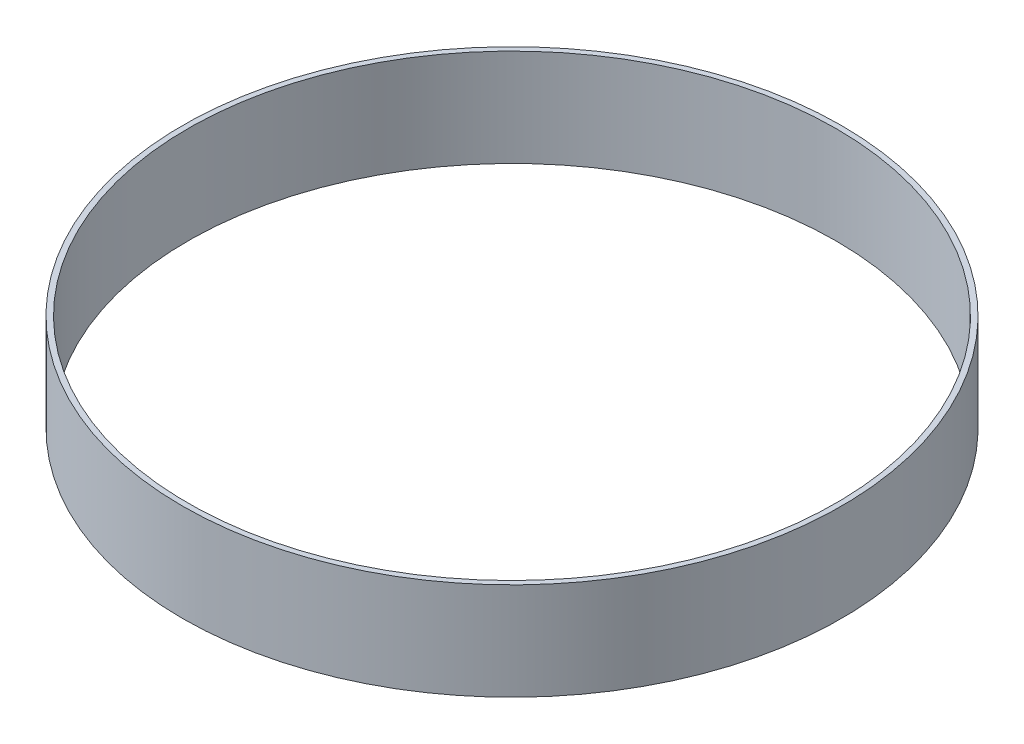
ISO-10303-21;
HEADER;
FILE_DESCRIPTION(('STEP AP214'),'2;1');
FILE_NAME('part.step','',(''),(''),'','','');
FILE_SCHEMA(('AUTOMOTIVE_DESIGN { 1 0 10303 214 1 1 1 1 }'));
ENDSEC;
DATA;
#1=APPLICATION_CONTEXT('core data for automotive mechanical design processes');
#2=APPLICATION_PROTOCOL_DEFINITION('international standard','automotive_design',2000,#1);
#3=PRODUCT_CONTEXT('',#1,'mechanical');
#4=PRODUCT('Part','Part','',(#3));
#5=PRODUCT_RELATED_PRODUCT_CATEGORY('part','',(#4));
#6=PRODUCT_DEFINITION_FORMATION('','',#4);
#7=PRODUCT_DEFINITION_CONTEXT('part definition',#1,'design');
#8=PRODUCT_DEFINITION('design','',#6,#7);
#9=PRODUCT_DEFINITION_SHAPE('','',#8);
#10=(LENGTH_UNIT() NAMED_UNIT(*) SI_UNIT(.MILLI.,.METRE.));
#11=(NAMED_UNIT(*) PLANE_ANGLE_UNIT() SI_UNIT($,.RADIAN.));
#12=(NAMED_UNIT(*) SI_UNIT($,.STERADIAN.) SOLID_ANGLE_UNIT());
#13=UNCERTAINTY_MEASURE_WITH_UNIT(LENGTH_MEASURE(1.E-05),#10,'distance_accuracy_value','');
#14=(GEOMETRIC_REPRESENTATION_CONTEXT(3) GLOBAL_UNCERTAINTY_ASSIGNED_CONTEXT((#13)) GLOBAL_UNIT_ASSIGNED_CONTEXT((#10,
#11,#12)) REPRESENTATION_CONTEXT('',''));
#15=CARTESIAN_POINT('',(0.,0.,0.));
#16=DIRECTION('',(0.,0.,1.));
#17=DIRECTION('',(1.,0.,0.));
#18=AXIS2_PLACEMENT_3D('',#15,#16,#17);
#19=CARTESIAN_POINT('',(0.,76.2,0.));
#20=DIRECTION('',(0.,1.,0.));
#21=DIRECTION('',(0.,0.,1.));
#22=AXIS2_PLACEMENT_3D('',#19,#20,#21);
#23=PLANE('',#22);
#24=CARTESIAN_POINT('',(0.,76.2,0.));
#25=DIRECTION('',(0.,1.,0.));
#26=DIRECTION('',(0.,0.,1.));
#27=AXIS2_PLACEMENT_3D('',#24,#25,#26);
#28=CIRCLE('',#27,257.96875);
#29=CARTESIAN_POINT('',(0.,76.2,-257.96875));
#30=VERTEX_POINT('',#29);
#31=EDGE_CURVE('E10',#30,#30,#28,.T.);
#32=ORIENTED_EDGE('',*,*,#31,.T.);
#33=EDGE_LOOP('',(#32));
#34=FACE_BOUND('',#33,.T.);
#35=CARTESIAN_POINT('',(0.,76.2,0.));
#36=DIRECTION('',(0.,1.,0.));
#37=DIRECTION('',(0.,0.,1.));
#38=AXIS2_PLACEMENT_3D('',#35,#36,#37);
#39=CIRCLE('',#38,253.79299);
#40=CARTESIAN_POINT('',(0.,76.2,-253.79299));
#41=VERTEX_POINT('',#40);
#42=EDGE_CURVE('E45',#41,#41,#39,.T.);
#43=ORIENTED_EDGE('',*,*,#42,.F.);
#44=EDGE_LOOP('',(#43));
#45=FACE_BOUND('',#44,.T.);
#46=ADVANCED_FACE('F34',(#34,#45),#23,.T.);
#47=CARTESIAN_POINT('',(0.,0.,0.));
#48=DIRECTION('',(0.,1.,0.));
#49=DIRECTION('',(0.,0.,1.));
#50=AXIS2_PLACEMENT_3D('',#47,#48,#49);
#51=PLANE('',#50);
#52=CARTESIAN_POINT('',(0.,0.,0.));
#53=DIRECTION('',(0.,1.,0.));
#54=DIRECTION('',(0.,0.,1.));
#55=AXIS2_PLACEMENT_3D('',#52,#53,#54);
#56=CIRCLE('',#55,257.96875);
#57=CARTESIAN_POINT('',(0.,0.,-257.96875));
#58=VERTEX_POINT('',#57);
#59=EDGE_CURVE('E38',#58,#58,#56,.T.);
#60=ORIENTED_EDGE('',*,*,#59,.F.);
#61=EDGE_LOOP('',(#60));
#62=FACE_BOUND('',#61,.T.);
#63=CARTESIAN_POINT('',(0.,0.,0.));
#64=DIRECTION('',(0.,1.,0.));
#65=DIRECTION('',(0.,0.,1.));
#66=AXIS2_PLACEMENT_3D('',#63,#64,#65);
#67=CIRCLE('',#66,253.79299);
#68=CARTESIAN_POINT('',(0.,0.,-253.79299));
#69=VERTEX_POINT('',#68);
#70=EDGE_CURVE('E47',#69,#69,#67,.T.);
#71=ORIENTED_EDGE('',*,*,#70,.T.);
#72=EDGE_LOOP('',(#71));
#73=FACE_BOUND('',#72,.T.);
#74=ADVANCED_FACE('F57',(#62,#73),#51,.F.);
#75=CARTESIAN_POINT('',(0.,76.2,0.));
#76=DIRECTION('',(0.,-1.,0.));
#77=DIRECTION('',(0.,0.,-1.));
#78=AXIS2_PLACEMENT_3D('',#75,#76,#77);
#79=CYLINDRICAL_SURFACE('',#78,257.96875);
#80=CARTESIAN_POINT('',(0.,76.2,-257.96875));
#81=CARTESIAN_POINT('',(0.,75.40625,-257.96875));
#82=CARTESIAN_POINT('',(0.,74.6125,-257.96875));
#83=CARTESIAN_POINT('',(0.,73.025,-257.96875));
#84=CARTESIAN_POINT('',(0.,72.23125,-257.96875));
#85=CARTESIAN_POINT('',(0.,70.64375,-257.96875));
#86=CARTESIAN_POINT('',(0.,69.85,-257.96875));
#87=CARTESIAN_POINT('',(0.,68.2625,-257.96875));
#88=CARTESIAN_POINT('',(0.,67.46875,-257.96875));
#89=CARTESIAN_POINT('',(0.,65.88125,-257.96875));
#90=CARTESIAN_POINT('',(0.,65.0875,-257.96875));
#91=CARTESIAN_POINT('',(0.,63.5,-257.96875));
#92=CARTESIAN_POINT('',(0.,62.70625,-257.96875));
#93=CARTESIAN_POINT('',(0.,61.11875,-257.96875));
#94=CARTESIAN_POINT('',(0.,60.325,-257.96875));
#95=CARTESIAN_POINT('',(0.,58.7375,-257.96875));
#96=CARTESIAN_POINT('',(0.,57.94375,-257.96875));
#97=CARTESIAN_POINT('',(0.,56.35625,-257.96875));
#98=CARTESIAN_POINT('',(0.,55.5625,-257.96875));
#99=CARTESIAN_POINT('',(0.,53.975,-257.96875));
#100=CARTESIAN_POINT('',(0.,53.18125,-257.96875));
#101=CARTESIAN_POINT('',(0.,51.59375,-257.96875));
#102=CARTESIAN_POINT('',(0.,50.8,-257.96875));
#103=CARTESIAN_POINT('',(0.,49.2125,-257.96875));
#104=CARTESIAN_POINT('',(0.,48.41875,-257.96875));
#105=CARTESIAN_POINT('',(0.,46.83125,-257.96875));
#106=CARTESIAN_POINT('',(0.,46.0375,-257.96875));
#107=CARTESIAN_POINT('',(0.,44.45,-257.96875));
#108=CARTESIAN_POINT('',(0.,43.65625,-257.96875));
#109=CARTESIAN_POINT('',(0.,42.06875,-257.96875));
#110=CARTESIAN_POINT('',(0.,41.275,-257.96875));
#111=CARTESIAN_POINT('',(0.,39.6875,-257.96875));
#112=CARTESIAN_POINT('',(0.,38.89375,-257.96875));
#113=CARTESIAN_POINT('',(0.,37.30625,-257.96875));
#114=CARTESIAN_POINT('',(0.,36.5125,-257.96875));
#115=CARTESIAN_POINT('',(0.,34.925,-257.96875));
#116=CARTESIAN_POINT('',(0.,34.13125,-257.96875));
#117=CARTESIAN_POINT('',(0.,32.54375,-257.96875));
#118=CARTESIAN_POINT('',(0.,31.75,-257.96875));
#119=CARTESIAN_POINT('',(0.,30.1625,-257.96875));
#120=CARTESIAN_POINT('',(0.,29.36875,-257.96875));
#121=CARTESIAN_POINT('',(0.,27.78125,-257.96875));
#122=CARTESIAN_POINT('',(0.,26.9875,-257.96875));
#123=CARTESIAN_POINT('',(0.,25.4,-257.96875));
#124=CARTESIAN_POINT('',(0.,24.60625,-257.96875));
#125=CARTESIAN_POINT('',(0.,23.01875,-257.96875));
#126=CARTESIAN_POINT('',(0.,22.225,-257.96875));
#127=CARTESIAN_POINT('',(0.,20.6375,-257.96875));
#128=CARTESIAN_POINT('',(0.,19.84375,-257.96875));
#129=CARTESIAN_POINT('',(0.,18.25625,-257.96875));
#130=CARTESIAN_POINT('',(0.,17.4625,-257.96875));
#131=CARTESIAN_POINT('',(0.,15.875,-257.96875));
#132=CARTESIAN_POINT('',(0.,15.08125,-257.96875));
#133=CARTESIAN_POINT('',(0.,13.49375,-257.96875));
#134=CARTESIAN_POINT('',(0.,12.7,-257.96875));
#135=CARTESIAN_POINT('',(0.,11.1125,-257.96875));
#136=CARTESIAN_POINT('',(0.,10.31875,-257.96875));
#137=CARTESIAN_POINT('',(0.,8.73125,-257.96875));
#138=CARTESIAN_POINT('',(0.,7.93750000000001,-257.96875));
#139=CARTESIAN_POINT('',(0.,6.35,-257.96875));
#140=CARTESIAN_POINT('',(0.,5.55625,-257.96875));
#141=CARTESIAN_POINT('',(0.,3.96875,-257.96875));
#142=CARTESIAN_POINT('',(0.,3.175,-257.96875));
#143=CARTESIAN_POINT('',(0.,1.5875,-257.96875));
#144=CARTESIAN_POINT('',(0.,0.793750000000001,-257.96875));
#145=CARTESIAN_POINT('',(0.,0.,-257.96875));
#146=B_SPLINE_CURVE_WITH_KNOTS('',3,(#80,#81,#82,#83,#84,#85,#86,#87,#88,#89,#90,#91,#92,#93,
#94,#95,#96,#97,#98,#99,#100,#101,#102,#103,#104,#105,#106,#107,#108,#109,#110,#111,#112,#113,
#114,#115,#116,#117,#118,#119,#120,#121,#122,#123,#124,#125,#126,#127,#128,#129,#130,#131,#132,
#133,#134,#135,#136,#137,#138,#139,#140,#141,#142,#143,#144,#145),.UNSPECIFIED.,.F.,.F.,(4,2,2,
2,2,2,2,2,2,2,2,2,2,2,2,2,2,2,2,2,2,2,2,2,2,2,2,2,2,2,2,2,4),(0.,2.38124999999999,
4.76249999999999,7.14374999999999,9.52499999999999,11.90625,14.2875,16.66875,19.05,21.43125,
23.8125,26.19375,28.575,30.95625,33.3375,35.71875,38.1,40.48125,42.8625,45.24375,47.625,
50.00625,52.3875,54.76875,57.15,59.53125,61.9125,64.29375,66.675,69.05625,71.4375,73.81875,
76.2),.UNSPECIFIED.);
#147=EDGE_CURVE('BSEAM36',#30,#58,#146,.T.);
#148=ORIENTED_EDGE('',*,*,#31,.F.);
#149=ORIENTED_EDGE('',*,*,#59,.T.);
#150=ORIENTED_EDGE('',*,*,#147,.T.);
#151=ORIENTED_EDGE('',*,*,#147,.F.);
#152=EDGE_LOOP('',(#148,#150,#149,#151));
#153=FACE_BOUND('',#152,.T.);
#154=ADVANCED_FACE('F36',(#153),#79,.T.);
#155=CARTESIAN_POINT('',(0.,76.2,0.));
#156=DIRECTION('',(0.,-1.,0.));
#157=DIRECTION('',(0.,0.,-1.));
#158=AXIS2_PLACEMENT_3D('',#155,#156,#157);
#159=CYLINDRICAL_SURFACE('',#158,253.79299);
#160=CARTESIAN_POINT('',(0.,76.2,-253.79299));
#161=CARTESIAN_POINT('',(0.,75.40625,-253.79299));
#162=CARTESIAN_POINT('',(0.,74.6125,-253.79299));
#163=CARTESIAN_POINT('',(0.,73.025,-253.79299));
#164=CARTESIAN_POINT('',(0.,72.23125,-253.79299));
#165=CARTESIAN_POINT('',(0.,70.64375,-253.79299));
#166=CARTESIAN_POINT('',(0.,69.85,-253.79299));
#167=CARTESIAN_POINT('',(0.,68.2625,-253.79299));
#168=CARTESIAN_POINT('',(0.,67.46875,-253.79299));
#169=CARTESIAN_POINT('',(0.,65.88125,-253.79299));
#170=CARTESIAN_POINT('',(0.,65.0875,-253.79299));
#171=CARTESIAN_POINT('',(0.,63.5,-253.79299));
#172=CARTESIAN_POINT('',(0.,62.70625,-253.79299));
#173=CARTESIAN_POINT('',(0.,61.11875,-253.79299));
#174=CARTESIAN_POINT('',(0.,60.325,-253.79299));
#175=CARTESIAN_POINT('',(0.,58.7375,-253.79299));
#176=CARTESIAN_POINT('',(0.,57.94375,-253.79299));
#177=CARTESIAN_POINT('',(0.,56.35625,-253.79299));
#178=CARTESIAN_POINT('',(0.,55.5625,-253.79299));
#179=CARTESIAN_POINT('',(0.,53.975,-253.79299));
#180=CARTESIAN_POINT('',(0.,53.18125,-253.79299));
#181=CARTESIAN_POINT('',(0.,51.59375,-253.79299));
#182=CARTESIAN_POINT('',(0.,50.8,-253.79299));
#183=CARTESIAN_POINT('',(0.,49.2125,-253.79299));
#184=CARTESIAN_POINT('',(0.,48.41875,-253.79299));
#185=CARTESIAN_POINT('',(0.,46.83125,-253.79299));
#186=CARTESIAN_POINT('',(0.,46.0375,-253.79299));
#187=CARTESIAN_POINT('',(0.,44.45,-253.79299));
#188=CARTESIAN_POINT('',(0.,43.65625,-253.79299));
#189=CARTESIAN_POINT('',(0.,42.06875,-253.79299));
#190=CARTESIAN_POINT('',(0.,41.275,-253.79299));
#191=CARTESIAN_POINT('',(0.,39.6875,-253.79299));
#192=CARTESIAN_POINT('',(0.,38.89375,-253.79299));
#193=CARTESIAN_POINT('',(0.,37.30625,-253.79299));
#194=CARTESIAN_POINT('',(0.,36.5125,-253.79299));
#195=CARTESIAN_POINT('',(0.,34.925,-253.79299));
#196=CARTESIAN_POINT('',(0.,34.13125,-253.79299));
#197=CARTESIAN_POINT('',(0.,32.54375,-253.79299));
#198=CARTESIAN_POINT('',(0.,31.75,-253.79299));
#199=CARTESIAN_POINT('',(0.,30.1625,-253.79299));
#200=CARTESIAN_POINT('',(0.,29.36875,-253.79299));
#201=CARTESIAN_POINT('',(0.,27.78125,-253.79299));
#202=CARTESIAN_POINT('',(0.,26.9875,-253.79299));
#203=CARTESIAN_POINT('',(0.,25.4,-253.79299));
#204=CARTESIAN_POINT('',(0.,24.60625,-253.79299));
#205=CARTESIAN_POINT('',(0.,23.01875,-253.79299));
#206=CARTESIAN_POINT('',(0.,22.225,-253.79299));
#207=CARTESIAN_POINT('',(0.,20.6375,-253.79299));
#208=CARTESIAN_POINT('',(0.,19.84375,-253.79299));
#209=CARTESIAN_POINT('',(0.,18.25625,-253.79299));
#210=CARTESIAN_POINT('',(0.,17.4625,-253.79299));
#211=CARTESIAN_POINT('',(0.,15.875,-253.79299));
#212=CARTESIAN_POINT('',(0.,15.08125,-253.79299));
#213=CARTESIAN_POINT('',(0.,13.49375,-253.79299));
#214=CARTESIAN_POINT('',(0.,12.7,-253.79299));
#215=CARTESIAN_POINT('',(0.,11.1125,-253.79299));
#216=CARTESIAN_POINT('',(0.,10.31875,-253.79299));
#217=CARTESIAN_POINT('',(0.,8.73125,-253.79299));
#218=CARTESIAN_POINT('',(0.,7.93750000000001,-253.79299));
#219=CARTESIAN_POINT('',(0.,6.35,-253.79299));
#220=CARTESIAN_POINT('',(0.,5.55625,-253.79299));
#221=CARTESIAN_POINT('',(0.,3.96875,-253.79299));
#222=CARTESIAN_POINT('',(0.,3.175,-253.79299));
#223=CARTESIAN_POINT('',(0.,1.5875,-253.79299));
#224=CARTESIAN_POINT('',(0.,0.793750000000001,-253.79299));
#225=CARTESIAN_POINT('',(0.,0.,-253.79299));
#226=B_SPLINE_CURVE_WITH_KNOTS('',3,(#160,#161,#162,#163,#164,#165,#166,#167,#168,#169,#170,
#171,#172,#173,#174,#175,#176,#177,#178,#179,#180,#181,#182,#183,#184,#185,#186,#187,#188,#189,
#190,#191,#192,#193,#194,#195,#196,#197,#198,#199,#200,#201,#202,#203,#204,#205,#206,#207,#208,
#209,#210,#211,#212,#213,#214,#215,#216,#217,#218,#219,#220,#221,#222,#223,#224,#225),
.UNSPECIFIED.,.F.,.F.,(4,2,2,2,2,2,2,2,2,2,2,2,2,2,2,2,2,2,2,2,2,2,2,2,2,2,2,2,2,2,2,2,4),(0.,
2.38125,4.7625,7.14375,9.52500000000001,11.90625,14.2875,16.66875,19.05,21.43125,23.8125,
26.19375,28.575,30.95625,33.3375,35.71875,38.1,40.48125,42.8625,45.24375,47.625,50.00625,
52.3875,54.76875,57.15,59.53125,61.9125,64.29375,66.675,69.05625,71.4375,73.81875,76.2),.UNSPECIFIED.);
#227=EDGE_CURVE('BSEAM53',#41,#69,#226,.T.);
#228=ORIENTED_EDGE('',*,*,#42,.T.);
#229=ORIENTED_EDGE('',*,*,#70,.F.);
#230=ORIENTED_EDGE('',*,*,#227,.T.);
#231=ORIENTED_EDGE('',*,*,#227,.F.);
#232=EDGE_LOOP('',(#228,#230,#229,#231));
#233=FACE_BOUND('',#232,.T.);
#234=ADVANCED_FACE('F53',(#233),#159,.F.);
#235=CLOSED_SHELL('',(#46,#74,#154,#234));
#236=MANIFOLD_SOLID_BREP('B2',#235);
#237=ADVANCED_BREP_SHAPE_REPRESENTATION('',(#18,#236),#14);
#238=SHAPE_DEFINITION_REPRESENTATION(#9,#237);
ENDSEC;
END-ISO-10303-21;
